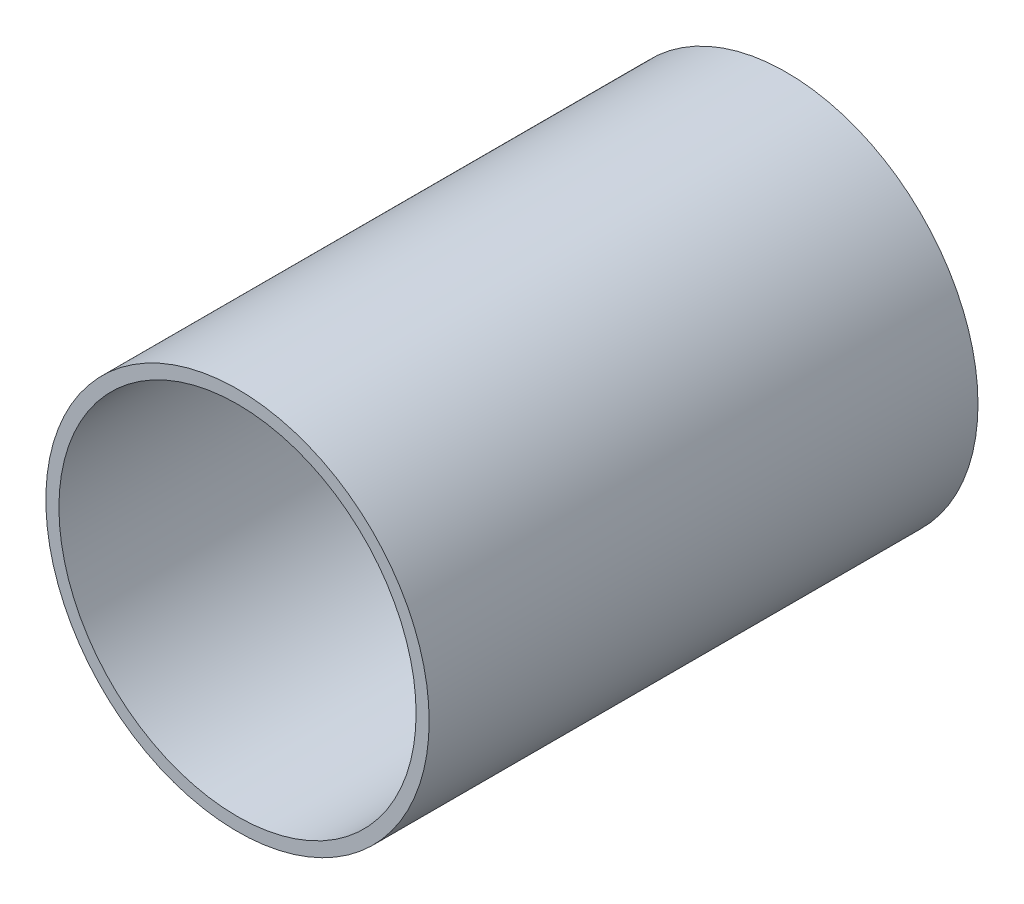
ISO-10303-21;
HEADER;
FILE_DESCRIPTION(('STEP AP214'),'2;1');
FILE_NAME('part.step','',(''),(''),'','','');
FILE_SCHEMA(('AUTOMOTIVE_DESIGN { 1 0 10303 214 1 1 1 1 }'));
ENDSEC;
DATA;
#1=APPLICATION_CONTEXT('core data for automotive mechanical design processes');
#2=APPLICATION_PROTOCOL_DEFINITION('international standard','automotive_design',2000,#1);
#3=PRODUCT_CONTEXT('',#1,'mechanical');
#4=PRODUCT('Part','Part','',(#3));
#5=PRODUCT_RELATED_PRODUCT_CATEGORY('part','',(#4));
#6=PRODUCT_DEFINITION_FORMATION('','',#4);
#7=PRODUCT_DEFINITION_CONTEXT('part definition',#1,'design');
#8=PRODUCT_DEFINITION('design','',#6,#7);
#9=PRODUCT_DEFINITION_SHAPE('','',#8);
#10=(LENGTH_UNIT() NAMED_UNIT(*) SI_UNIT(.MILLI.,.METRE.));
#11=(NAMED_UNIT(*) PLANE_ANGLE_UNIT() SI_UNIT($,.RADIAN.));
#12=(NAMED_UNIT(*) SI_UNIT($,.STERADIAN.) SOLID_ANGLE_UNIT());
#13=UNCERTAINTY_MEASURE_WITH_UNIT(LENGTH_MEASURE(1.E-05),#10,'distance_accuracy_value','');
#14=(GEOMETRIC_REPRESENTATION_CONTEXT(3) GLOBAL_UNCERTAINTY_ASSIGNED_CONTEXT((#13)) GLOBAL_UNIT_ASSIGNED_CONTEXT((#10,
#11,#12)) REPRESENTATION_CONTEXT('',''));
#15=CARTESIAN_POINT('',(0.,0.,0.));
#16=DIRECTION('',(0.,0.,1.));
#17=DIRECTION('',(1.,0.,0.));
#18=AXIS2_PLACEMENT_3D('',#15,#16,#17);
#19=CARTESIAN_POINT('',(0.,0.,63.));
#20=DIRECTION('',(0.,0.,1.));
#21=DIRECTION('',(1.,0.,0.));
#22=AXIS2_PLACEMENT_3D('',#19,#20,#21);
#23=PLANE('',#22);
#24=CARTESIAN_POINT('',(0.,0.,63.));
#25=DIRECTION('',(0.,0.,1.));
#26=DIRECTION('',(1.,0.,0.));
#27=AXIS2_PLACEMENT_3D('',#24,#25,#26);
#28=CIRCLE('',#27,22.);
#29=CARTESIAN_POINT('',(22.,0.,63.));
#30=VERTEX_POINT('',#29);
#31=EDGE_CURVE('E10',#30,#30,#28,.T.);
#32=ORIENTED_EDGE('',*,*,#31,.T.);
#33=EDGE_LOOP('',(#32));
#34=FACE_BOUND('',#33,.T.);
#35=CARTESIAN_POINT('',(0.,0.,63.));
#36=DIRECTION('',(0.,0.,1.));
#37=DIRECTION('',(1.,0.,0.));
#38=AXIS2_PLACEMENT_3D('',#35,#36,#37);
#39=CIRCLE('',#38,20.5);
#40=CARTESIAN_POINT('',(20.5,0.,63.));
#41=VERTEX_POINT('',#40);
#42=EDGE_CURVE('E40',#41,#41,#39,.T.);
#43=ORIENTED_EDGE('',*,*,#42,.F.);
#44=EDGE_LOOP('',(#43));
#45=FACE_BOUND('',#44,.T.);
#46=ADVANCED_FACE('F29',(#34,#45),#23,.T.);
#47=CARTESIAN_POINT('',(0.,0.,0.));
#48=DIRECTION('',(0.,0.,1.));
#49=DIRECTION('',(1.,0.,0.));
#50=AXIS2_PLACEMENT_3D('',#47,#48,#49);
#51=PLANE('',#50);
#52=CARTESIAN_POINT('',(0.,0.,0.));
#53=DIRECTION('',(0.,0.,1.));
#54=DIRECTION('',(1.,0.,0.));
#55=AXIS2_PLACEMENT_3D('',#52,#53,#54);
#56=CIRCLE('',#55,22.);
#57=CARTESIAN_POINT('',(22.,0.,0.));
#58=VERTEX_POINT('',#57);
#59=EDGE_CURVE('E33',#58,#58,#56,.T.);
#60=ORIENTED_EDGE('',*,*,#59,.F.);
#61=EDGE_LOOP('',(#60));
#62=FACE_BOUND('',#61,.T.);
#63=CARTESIAN_POINT('',(0.,0.,0.));
#64=DIRECTION('',(0.,0.,1.));
#65=DIRECTION('',(1.,0.,0.));
#66=AXIS2_PLACEMENT_3D('',#63,#64,#65);
#67=CIRCLE('',#66,20.5);
#68=CARTESIAN_POINT('',(20.5,0.,0.));
#69=VERTEX_POINT('',#68);
#70=EDGE_CURVE('E42',#69,#69,#67,.T.);
#71=ORIENTED_EDGE('',*,*,#70,.T.);
#72=EDGE_LOOP('',(#71));
#73=FACE_BOUND('',#72,.T.);
#74=ADVANCED_FACE('F52',(#62,#73),#51,.F.);
#75=CARTESIAN_POINT('',(0.,0.,63.));
#76=DIRECTION('',(0.,0.,-1.));
#77=DIRECTION('',(-1.,0.,0.));
#78=AXIS2_PLACEMENT_3D('',#75,#76,#77);
#79=CYLINDRICAL_SURFACE('',#78,22.);
#80=ORIENTED_EDGE('',*,*,#31,.F.);
#81=EDGE_LOOP('',(#80));
#82=FACE_BOUND('',#81,.T.);
#83=ORIENTED_EDGE('',*,*,#59,.T.);
#84=EDGE_LOOP('',(#83));
#85=FACE_BOUND('',#84,.T.);
#86=ADVANCED_FACE('F31',(#82,#85),#79,.T.);
#87=CARTESIAN_POINT('',(0.,0.,63.));
#88=DIRECTION('',(0.,0.,-1.));
#89=DIRECTION('',(-1.,0.,0.));
#90=AXIS2_PLACEMENT_3D('',#87,#88,#89);
#91=CYLINDRICAL_SURFACE('',#90,20.5);
#92=ORIENTED_EDGE('',*,*,#42,.T.);
#93=EDGE_LOOP('',(#92));
#94=FACE_BOUND('',#93,.T.);
#95=ORIENTED_EDGE('',*,*,#70,.F.);
#96=EDGE_LOOP('',(#95));
#97=FACE_BOUND('',#96,.T.);
#98=ADVANCED_FACE('F48',(#94,#97),#91,.F.);
#99=CLOSED_SHELL('',(#46,#74,#86,#98));
#100=MANIFOLD_SOLID_BREP('B2',#99);
#101=ADVANCED_BREP_SHAPE_REPRESENTATION('',(#18,#100),#14);
#102=SHAPE_DEFINITION_REPRESENTATION(#9,#101);
ENDSEC;
END-ISO-10303-21;
